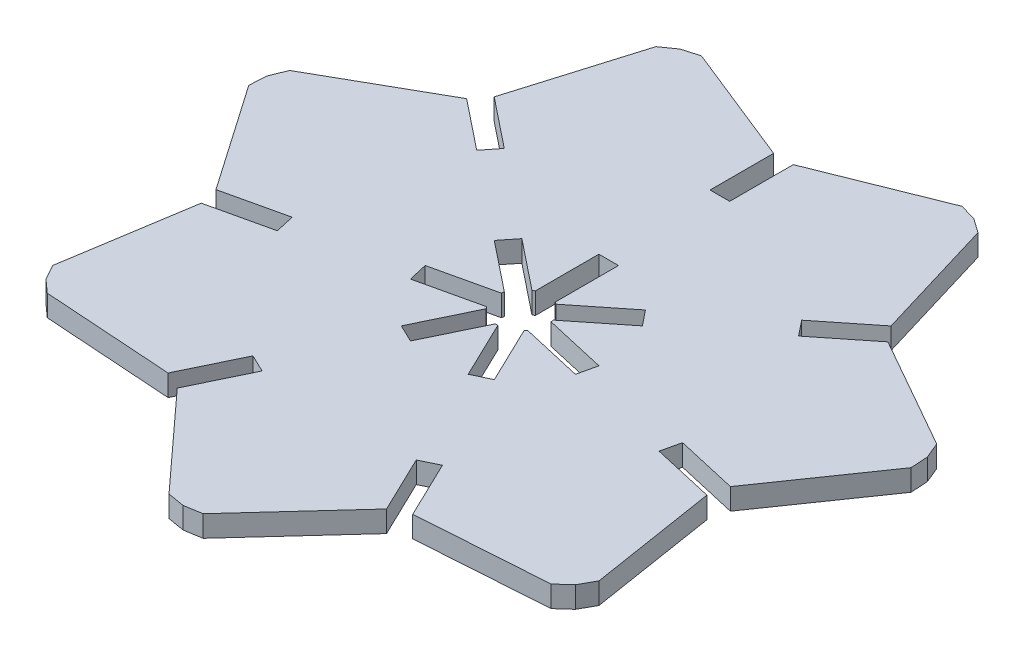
from build123d import *

# Parameters (mm, degrees)
CROQUIS1_R              = 39.9625
CROQUIS1_R_2            = 2.9625
SALIENTE_EXTRUIR1_DEPTH = 1.25
CORTAR_EXTRUIR2_DEPTH   = 57.570777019
MATRIZC1_COUNT          = 7


with BuildPart() as part:
    # Croquis1 → Saliente-Extruir1 (new, symmetric)
    with BuildSketch(Plane(origin=(0, 0, 0), x_dir=(1, 0, 0), z_dir=(0, 1, 0))):
        with Locations(Location((0, 0, 0), (0, 0, 270))):
            Circle(CROQUIS1_R)
        with Locations(Location((0, 0, 0), (0, 0, 270))):
            Circle(CROQUIS1_R_2, mode=Mode.SUBTRACT)
    extrude(amount=SALIENTE_EXTRUIR1_DEPTH, both=True)

    # Croquis2 → Cortar-Extruir2 (cut, symmetric)
    with BuildSketch(Plane(origin=(0, 1.25, 0), x_dir=(1, 0, 0), z_dir=(0, 1, 0))):
        Polygon((-29.082429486, 103.211352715), (29.082429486, 103.211352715), (29.082429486, 27.408277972), (16, 36.619686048), (1.15, 30.663386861), (1.15, 23.211352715), (-1.15, 23.211352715), (-1.15, 30.663386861), (-16, 36.619686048), (-29.082429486, 27.408277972), align=None)
        with BuildLine():
            Line((-1.15, 2.730184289), (-1.15, 10.182218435))
            Line((-1.15, 10.182218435), (1.15, 10.182218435))
            Line((1.15, 10.182218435), (1.15, 2.730184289))
            ThreePointArc((1.15, 2.730184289), (0, 2.9625), (-1.15, 2.730184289))
        make_face()
    cortar_extruir2 = extrude(amount=CORTAR_EXTRUIR2_DEPTH, both=True, mode=Mode.SUBTRACT)

    # MatrizC1: Cortar-Extruir2 ×7 about axis
    matrizc1_axis = Axis((0, 0, 0), (0, 1, 0))
    for i in range(1, MATRIZC1_COUNT):
        add(cortar_extruir2.rotate(matrizc1_axis, i * 360 / MATRIZC1_COUNT), mode=Mode.SUBTRACT)


solid = part.part
